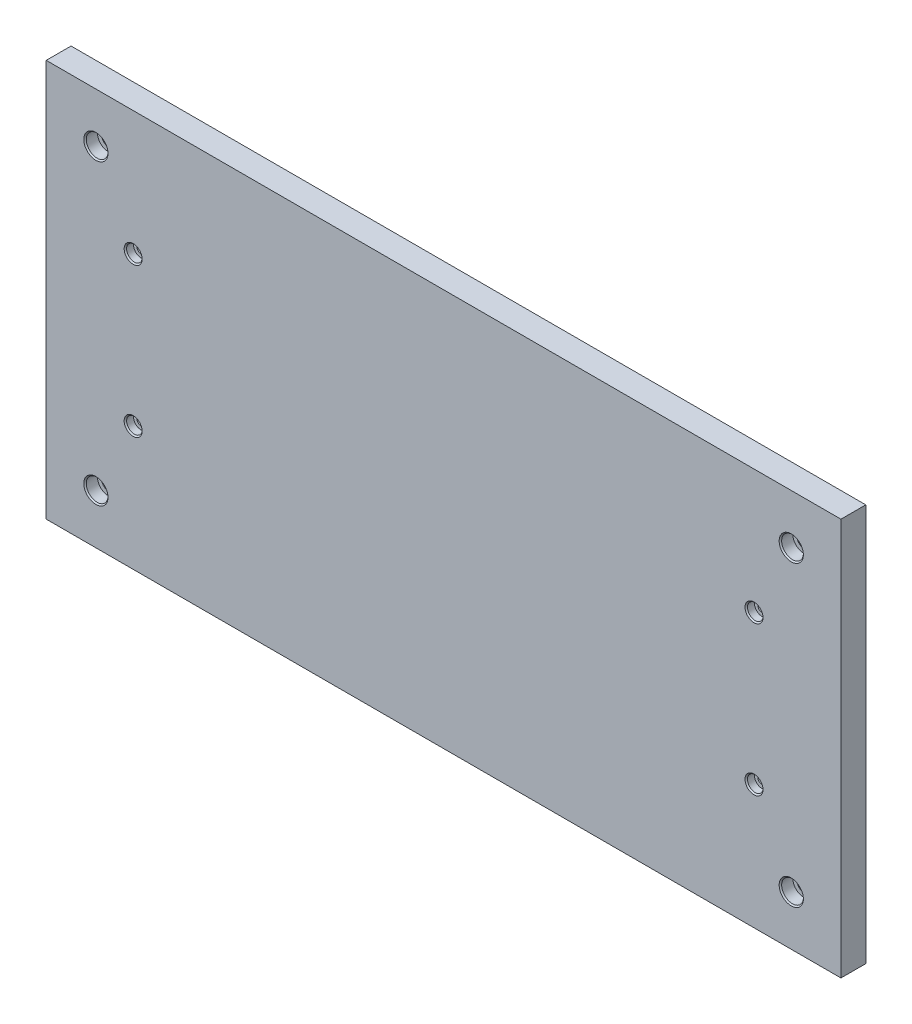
ISO-10303-21;
HEADER;
FILE_DESCRIPTION(('STEP AP214'),'2;1');
FILE_NAME('part.step','',(''),(''),'','','');
FILE_SCHEMA(('AUTOMOTIVE_DESIGN { 1 0 10303 214 1 1 1 1 }'));
ENDSEC;
DATA;
#1=APPLICATION_CONTEXT('core data for automotive mechanical design processes');
#2=APPLICATION_PROTOCOL_DEFINITION('international standard','automotive_design',2000,#1);
#3=PRODUCT_CONTEXT('',#1,'mechanical');
#4=PRODUCT('Part','Part','',(#3));
#5=PRODUCT_RELATED_PRODUCT_CATEGORY('part','',(#4));
#6=PRODUCT_DEFINITION_FORMATION('','',#4);
#7=PRODUCT_DEFINITION_CONTEXT('part definition',#1,'design');
#8=PRODUCT_DEFINITION('design','',#6,#7);
#9=PRODUCT_DEFINITION_SHAPE('','',#8);
#10=(LENGTH_UNIT() NAMED_UNIT(*) SI_UNIT(.MILLI.,.METRE.));
#11=(NAMED_UNIT(*) PLANE_ANGLE_UNIT() SI_UNIT($,.RADIAN.));
#12=(NAMED_UNIT(*) SI_UNIT($,.STERADIAN.) SOLID_ANGLE_UNIT());
#13=UNCERTAINTY_MEASURE_WITH_UNIT(LENGTH_MEASURE(1.E-05),#10,'distance_accuracy_value','');
#14=(GEOMETRIC_REPRESENTATION_CONTEXT(3) GLOBAL_UNCERTAINTY_ASSIGNED_CONTEXT((#13)) GLOBAL_UNIT_ASSIGNED_CONTEXT((#10,
#11,#12)) REPRESENTATION_CONTEXT('',''));
#15=CARTESIAN_POINT('',(0.,0.,0.));
#16=DIRECTION('',(0.,0.,1.));
#17=DIRECTION('',(1.,0.,0.));
#18=AXIS2_PLACEMENT_3D('',#15,#16,#17);
#19=CARTESIAN_POINT('',(-107.332219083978,-40.2352360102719,12.7));
#20=DIRECTION('',(1.,0.,0.));
#21=DIRECTION('',(0.,0.,-1.));
#22=AXIS2_PLACEMENT_3D('',#19,#20,#21);
#23=PLANE('',#22);
#24=DIRECTION('',(0.,-1.,0.));
#25=VECTOR('',#24,1.);
#26=CARTESIAN_POINT('',(-107.332219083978,-40.2352360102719,0.));
#27=LINE('',#26,#25);
#28=CARTESIAN_POINT('',(-107.332219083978,-40.2352360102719,0.));
#29=VERTEX_POINT('',#28);
#30=CARTESIAN_POINT('',(-107.332219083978,-243.435236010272,0.));
#31=VERTEX_POINT('',#30);
#32=EDGE_CURVE('E266',#29,#31,#27,.T.);
#33=ORIENTED_EDGE('',*,*,#32,.T.);
#34=DIRECTION('',(0.,0.,-1.));
#35=VECTOR('',#34,1.);
#36=CARTESIAN_POINT('',(-107.332219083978,-243.435236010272,12.7));
#37=LINE('',#36,#35);
#38=CARTESIAN_POINT('',(-107.332219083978,-243.435236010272,12.7));
#39=VERTEX_POINT('',#38);
#40=EDGE_CURVE('E11',#39,#31,#37,.T.);
#41=ORIENTED_EDGE('',*,*,#40,.F.);
#42=DIRECTION('',(0.,-1.,0.));
#43=VECTOR('',#42,1.);
#44=CARTESIAN_POINT('',(-107.332219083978,-40.2352360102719,12.7));
#45=LINE('',#44,#43);
#46=CARTESIAN_POINT('',(-107.332219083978,-40.2352360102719,12.7));
#47=VERTEX_POINT('',#46);
#48=EDGE_CURVE('E267',#47,#39,#45,.T.);
#49=ORIENTED_EDGE('',*,*,#48,.F.);
#50=DIRECTION('',(0.,0.,-1.));
#51=VECTOR('',#50,1.);
#52=CARTESIAN_POINT('',(-107.332219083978,-40.2352360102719,12.7));
#53=LINE('',#52,#51);
#54=EDGE_CURVE('E277',#47,#29,#53,.T.);
#55=ORIENTED_EDGE('',*,*,#54,.T.);
#56=EDGE_LOOP('',(#33,#41,#49,#55));
#57=FACE_BOUND('',#56,.T.);
#58=ADVANCED_FACE('F45',(#57),#23,.F.);
#59=CARTESIAN_POINT('',(-107.332219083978,-243.435236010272,12.7));
#60=DIRECTION('',(0.,1.,0.));
#61=DIRECTION('',(0.,0.,1.));
#62=AXIS2_PLACEMENT_3D('',#59,#60,#61);
#63=PLANE('',#62);
#64=DIRECTION('',(1.,0.,0.));
#65=VECTOR('',#64,1.);
#66=CARTESIAN_POINT('',(-107.332219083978,-243.435236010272,0.));
#67=LINE('',#66,#65);
#68=CARTESIAN_POINT('',(299.067780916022,-243.435236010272,0.));
#69=VERTEX_POINT('',#68);
#70=EDGE_CURVE('E281',#31,#69,#67,.T.);
#71=ORIENTED_EDGE('',*,*,#70,.T.);
#72=DIRECTION('',(0.,0.,-1.));
#73=VECTOR('',#72,1.);
#74=CARTESIAN_POINT('',(299.067780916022,-243.435236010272,12.7));
#75=LINE('',#74,#73);
#76=CARTESIAN_POINT('',(299.067780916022,-243.435236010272,12.7));
#77=VERTEX_POINT('',#76);
#78=EDGE_CURVE('E54',#77,#69,#75,.T.);
#79=ORIENTED_EDGE('',*,*,#78,.F.);
#80=DIRECTION('',(1.,0.,0.));
#81=VECTOR('',#80,1.);
#82=CARTESIAN_POINT('',(-107.332219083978,-243.435236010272,12.7));
#83=LINE('',#82,#81);
#84=EDGE_CURVE('E93',#39,#77,#83,.T.);
#85=ORIENTED_EDGE('',*,*,#84,.F.);
#86=ORIENTED_EDGE('',*,*,#40,.T.);
#87=EDGE_LOOP('',(#71,#79,#85,#86));
#88=FACE_BOUND('',#87,.T.);
#89=ADVANCED_FACE('F312',(#88),#63,.F.);
#90=CARTESIAN_POINT('',(299.067780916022,-40.2352360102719,12.7));
#91=DIRECTION('',(-1.,0.,0.));
#92=DIRECTION('',(0.,0.,1.));
#93=AXIS2_PLACEMENT_3D('',#90,#91,#92);
#94=PLANE('',#93);
#95=DIRECTION('',(0.,1.,0.));
#96=VECTOR('',#95,1.);
#97=CARTESIAN_POINT('',(299.067780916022,-40.2352360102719,0.));
#98=LINE('',#97,#96);
#99=CARTESIAN_POINT('',(299.067780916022,-40.2352360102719,0.));
#100=VERTEX_POINT('',#99);
#101=EDGE_CURVE('E80',#69,#100,#98,.T.);
#102=ORIENTED_EDGE('',*,*,#101,.T.);
#103=DIRECTION('',(0.,0.,-1.));
#104=VECTOR('',#103,1.);
#105=CARTESIAN_POINT('',(299.067780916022,-40.2352360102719,12.7));
#106=LINE('',#105,#104);
#107=CARTESIAN_POINT('',(299.067780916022,-40.2352360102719,12.7));
#108=VERTEX_POINT('',#107);
#109=EDGE_CURVE('E290',#108,#100,#106,.T.);
#110=ORIENTED_EDGE('',*,*,#109,.F.);
#111=DIRECTION('',(0.,1.,0.));
#112=VECTOR('',#111,1.);
#113=CARTESIAN_POINT('',(299.067780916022,-40.2352360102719,12.7));
#114=LINE('',#113,#112);
#115=EDGE_CURVE('E272',#77,#108,#114,.T.);
#116=ORIENTED_EDGE('',*,*,#115,.F.);
#117=ORIENTED_EDGE('',*,*,#78,.T.);
#118=EDGE_LOOP('',(#102,#110,#116,#117));
#119=FACE_BOUND('',#118,.T.);
#120=ADVANCED_FACE('F295',(#119),#94,.F.);
#121=CARTESIAN_POINT('',(-107.332219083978,-40.2352360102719,12.7));
#122=DIRECTION('',(0.,-1.,0.));
#123=DIRECTION('',(0.,0.,-1.));
#124=AXIS2_PLACEMENT_3D('',#121,#122,#123);
#125=PLANE('',#124);
#126=DIRECTION('',(-1.,0.,0.));
#127=VECTOR('',#126,1.);
#128=CARTESIAN_POINT('',(-107.332219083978,-40.2352360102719,0.));
#129=LINE('',#128,#127);
#130=EDGE_CURVE('E86',#100,#29,#129,.T.);
#131=ORIENTED_EDGE('',*,*,#130,.T.);
#132=ORIENTED_EDGE('',*,*,#54,.F.);
#133=DIRECTION('',(-1.,0.,0.));
#134=VECTOR('',#133,1.);
#135=CARTESIAN_POINT('',(-107.332219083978,-40.2352360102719,12.7));
#136=LINE('',#135,#134);
#137=EDGE_CURVE('E62',#108,#47,#136,.T.);
#138=ORIENTED_EDGE('',*,*,#137,.F.);
#139=ORIENTED_EDGE('',*,*,#109,.T.);
#140=EDGE_LOOP('',(#131,#132,#138,#139));
#141=FACE_BOUND('',#140,.T.);
#142=ADVANCED_FACE('F302',(#141),#125,.F.);
#143=CARTESIAN_POINT('',(0.,0.,12.7));
#144=DIRECTION('',(0.,0.,1.));
#145=DIRECTION('',(1.,0.,0.));
#146=AXIS2_PLACEMENT_3D('',#143,#144,#145);
#147=PLANE('',#146);
#148=CARTESIAN_POINT('',(-62.8822190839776,-179.935236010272,12.7));
#149=DIRECTION('',(0.,0.,1.));
#150=DIRECTION('',(1.,0.,0.));
#151=AXIS2_PLACEMENT_3D('',#148,#149,#150);
#152=CIRCLE('',#151,4.60375);
#153=CARTESIAN_POINT('',(-58.2784690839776,-179.935236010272,12.7));
#154=VERTEX_POINT('',#153);
#155=EDGE_CURVE('E796',#154,#154,#152,.T.);
#156=ORIENTED_EDGE('',*,*,#155,.F.);
#157=EDGE_LOOP('',(#156));
#158=FACE_BOUND('',#157,.T.);
#159=CARTESIAN_POINT('',(254.617780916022,-103.735236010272,12.7));
#160=DIRECTION('',(0.,0.,1.));
#161=DIRECTION('',(1.,0.,0.));
#162=AXIS2_PLACEMENT_3D('',#159,#160,#161);
#163=CIRCLE('',#162,4.60375000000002);
#164=CARTESIAN_POINT('',(259.221530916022,-103.735236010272,12.7));
#165=VERTEX_POINT('',#164);
#166=EDGE_CURVE('E117',#165,#165,#163,.T.);
#167=ORIENTED_EDGE('',*,*,#166,.F.);
#168=EDGE_LOOP('',(#167));
#169=FACE_BOUND('',#168,.T.);
#170=CARTESIAN_POINT('',(254.617780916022,-179.935236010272,12.7));
#171=DIRECTION('',(0.,0.,1.));
#172=DIRECTION('',(1.,0.,0.));
#173=AXIS2_PLACEMENT_3D('',#170,#171,#172);
#174=CIRCLE('',#173,4.60375000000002);
#175=CARTESIAN_POINT('',(259.221530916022,-179.935236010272,12.7));
#176=VERTEX_POINT('',#175);
#177=EDGE_CURVE('E146',#176,#176,#174,.T.);
#178=ORIENTED_EDGE('',*,*,#177,.F.);
#179=EDGE_LOOP('',(#178));
#180=FACE_BOUND('',#179,.T.);
#181=CARTESIAN_POINT('',(-62.8822190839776,-103.735236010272,12.7));
#182=DIRECTION('',(0.,0.,1.));
#183=DIRECTION('',(1.,0.,0.));
#184=AXIS2_PLACEMENT_3D('',#181,#182,#183);
#185=CIRCLE('',#184,4.60375);
#186=CARTESIAN_POINT('',(-58.2784690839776,-103.735236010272,12.7));
#187=VERTEX_POINT('',#186);
#188=EDGE_CURVE('E166',#187,#187,#185,.T.);
#189=ORIENTED_EDGE('',*,*,#188,.F.);
#190=EDGE_LOOP('',(#189));
#191=FACE_BOUND('',#190,.T.);
#192=CARTESIAN_POINT('',(-81.9322190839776,-65.6352360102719,12.7));
#193=DIRECTION('',(0.,0.,1.));
#194=DIRECTION('',(1.,0.,0.));
#195=AXIS2_PLACEMENT_3D('',#192,#193,#194);
#196=CIRCLE('',#195,6.19125);
#197=CARTESIAN_POINT('',(-75.7409690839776,-65.6352360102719,12.7));
#198=VERTEX_POINT('',#197);
#199=EDGE_CURVE('E186',#198,#198,#196,.T.);
#200=ORIENTED_EDGE('',*,*,#199,.F.);
#201=EDGE_LOOP('',(#200));
#202=FACE_BOUND('',#201,.T.);
#203=CARTESIAN_POINT('',(-81.9322190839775,-218.035236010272,12.7));
#204=DIRECTION('',(0.,0.,1.));
#205=DIRECTION('',(1.,0.,0.));
#206=AXIS2_PLACEMENT_3D('',#203,#204,#205);
#207=CIRCLE('',#206,6.19125);
#208=CARTESIAN_POINT('',(-75.7409690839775,-218.035236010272,12.7));
#209=VERTEX_POINT('',#208);
#210=EDGE_CURVE('E206',#209,#209,#207,.T.);
#211=ORIENTED_EDGE('',*,*,#210,.F.);
#212=EDGE_LOOP('',(#211));
#213=FACE_BOUND('',#212,.T.);
#214=CARTESIAN_POINT('',(273.667780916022,-218.035236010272,12.7));
#215=DIRECTION('',(0.,0.,1.));
#216=DIRECTION('',(1.,0.,0.));
#217=AXIS2_PLACEMENT_3D('',#214,#215,#216);
#218=CIRCLE('',#217,6.19124999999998);
#219=CARTESIAN_POINT('',(279.859030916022,-218.035236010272,12.7));
#220=VERTEX_POINT('',#219);
#221=EDGE_CURVE('E226',#220,#220,#218,.T.);
#222=ORIENTED_EDGE('',*,*,#221,.F.);
#223=EDGE_LOOP('',(#222));
#224=FACE_BOUND('',#223,.T.);
#225=CARTESIAN_POINT('',(273.667780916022,-65.6352360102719,12.7));
#226=DIRECTION('',(0.,0.,1.));
#227=DIRECTION('',(1.,0.,0.));
#228=AXIS2_PLACEMENT_3D('',#225,#226,#227);
#229=CIRCLE('',#228,6.19124999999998);
#230=CARTESIAN_POINT('',(279.859030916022,-65.6352360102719,12.7));
#231=VERTEX_POINT('',#230);
#232=EDGE_CURVE('E246',#231,#231,#229,.T.);
#233=ORIENTED_EDGE('',*,*,#232,.F.);
#234=EDGE_LOOP('',(#233));
#235=FACE_BOUND('',#234,.T.);
#236=ORIENTED_EDGE('',*,*,#48,.T.);
#237=ORIENTED_EDGE('',*,*,#84,.T.);
#238=ORIENTED_EDGE('',*,*,#115,.T.);
#239=ORIENTED_EDGE('',*,*,#137,.T.);
#240=EDGE_LOOP('',(#236,#237,#238,#239));
#241=FACE_BOUND('',#240,.T.);
#242=ADVANCED_FACE('F304',(#158,#169,#180,#191,#202,#213,#224,#235,#241),#147,.T.);
#243=CARTESIAN_POINT('',(0.,0.,0.));
#244=DIRECTION('',(0.,0.,1.));
#245=DIRECTION('',(1.,0.,0.));
#246=AXIS2_PLACEMENT_3D('',#243,#244,#245);
#247=PLANE('',#246);
#248=CARTESIAN_POINT('',(-81.9322190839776,-65.6352360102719,0.));
#249=DIRECTION('',(0.,0.,1.));
#250=DIRECTION('',(1.,0.,0.));
#251=AXIS2_PLACEMENT_3D('',#248,#249,#250);
#252=CIRCLE('',#251,3.37820000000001);
#253=CARTESIAN_POINT('',(-78.5540190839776,-65.6352360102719,0.));
#254=VERTEX_POINT('',#253);
#255=EDGE_CURVE('E202',#254,#254,#252,.T.);
#256=ORIENTED_EDGE('',*,*,#255,.T.);
#257=EDGE_LOOP('',(#256));
#258=FACE_BOUND('',#257,.T.);
#259=CARTESIAN_POINT('',(-81.9322190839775,-218.035236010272,0.));
#260=DIRECTION('',(0.,0.,1.));
#261=DIRECTION('',(1.,0.,0.));
#262=AXIS2_PLACEMENT_3D('',#259,#260,#261);
#263=CIRCLE('',#262,3.37820000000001);
#264=CARTESIAN_POINT('',(-78.5540190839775,-218.035236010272,0.));
#265=VERTEX_POINT('',#264);
#266=EDGE_CURVE('E222',#265,#265,#263,.T.);
#267=ORIENTED_EDGE('',*,*,#266,.T.);
#268=EDGE_LOOP('',(#267));
#269=FACE_BOUND('',#268,.T.);
#270=CARTESIAN_POINT('',(273.667780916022,-218.035236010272,0.));
#271=DIRECTION('',(0.,0.,1.));
#272=DIRECTION('',(1.,0.,0.));
#273=AXIS2_PLACEMENT_3D('',#270,#271,#272);
#274=CIRCLE('',#273,3.3782);
#275=CARTESIAN_POINT('',(277.045980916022,-218.035236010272,0.));
#276=VERTEX_POINT('',#275);
#277=EDGE_CURVE('E242',#276,#276,#274,.T.);
#278=ORIENTED_EDGE('',*,*,#277,.T.);
#279=EDGE_LOOP('',(#278));
#280=FACE_BOUND('',#279,.T.);
#281=CARTESIAN_POINT('',(273.667780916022,-65.6352360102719,0.));
#282=DIRECTION('',(0.,0.,1.));
#283=DIRECTION('',(1.,0.,0.));
#284=AXIS2_PLACEMENT_3D('',#281,#282,#283);
#285=CIRCLE('',#284,3.3782);
#286=CARTESIAN_POINT('',(277.045980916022,-65.6352360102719,0.));
#287=VERTEX_POINT('',#286);
#288=EDGE_CURVE('E262',#287,#287,#285,.T.);
#289=ORIENTED_EDGE('',*,*,#288,.T.);
#290=EDGE_LOOP('',(#289));
#291=FACE_BOUND('',#290,.T.);
#292=ORIENTED_EDGE('',*,*,#32,.F.);
#293=ORIENTED_EDGE('',*,*,#130,.F.);
#294=ORIENTED_EDGE('',*,*,#101,.F.);
#295=ORIENTED_EDGE('',*,*,#70,.F.);
#296=EDGE_LOOP('',(#292,#293,#294,#295));
#297=FACE_BOUND('',#296,.T.);
#298=ADVANCED_FACE('F298',(#258,#269,#280,#291,#297),#247,.F.);
#299=CARTESIAN_POINT('',(273.667780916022,-65.6352360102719,12.7));
#300=DIRECTION('',(0.,0.,1.));
#301=DIRECTION('',(1.,0.,0.));
#302=AXIS2_PLACEMENT_3D('',#299,#300,#301);
#303=CYLINDRICAL_SURFACE('',#302,3.3782);
#304=ORIENTED_EDGE('',*,*,#288,.F.);
#305=EDGE_LOOP('',(#304));
#306=FACE_BOUND('',#305,.T.);
#307=CARTESIAN_POINT('',(273.667780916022,-65.6352360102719,6.35));
#308=DIRECTION('',(0.,0.,1.));
#309=DIRECTION('',(1.,0.,0.));
#310=AXIS2_PLACEMENT_3D('',#307,#308,#309);
#311=CIRCLE('',#310,3.3782);
#312=CARTESIAN_POINT('',(277.045980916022,-65.6352360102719,6.35));
#313=VERTEX_POINT('',#312);
#314=EDGE_CURVE('E258',#313,#313,#311,.T.);
#315=ORIENTED_EDGE('',*,*,#314,.T.);
#316=EDGE_LOOP('',(#315));
#317=FACE_BOUND('',#316,.T.);
#318=ADVANCED_FACE('F346',(#306,#317),#303,.F.);
#319=CARTESIAN_POINT('',(279.224030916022,-65.6352360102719,6.35));
#320=DIRECTION('',(0.,0.,-1.));
#321=DIRECTION('',(-1.,0.,0.));
#322=AXIS2_PLACEMENT_3D('',#319,#320,#321);
#323=PLANE('',#322);
#324=ORIENTED_EDGE('',*,*,#314,.F.);
#325=EDGE_LOOP('',(#324));
#326=FACE_BOUND('',#325,.T.);
#327=CARTESIAN_POINT('',(273.667780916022,-65.6352360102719,6.35));
#328=DIRECTION('',(0.,0.,1.));
#329=DIRECTION('',(1.,0.,0.));
#330=AXIS2_PLACEMENT_3D('',#327,#328,#329);
#331=CIRCLE('',#330,5.55624999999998);
#332=CARTESIAN_POINT('',(279.224030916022,-65.6352360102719,6.35));
#333=VERTEX_POINT('',#332);
#334=EDGE_CURVE('E254',#333,#333,#331,.T.);
#335=ORIENTED_EDGE('',*,*,#334,.T.);
#336=EDGE_LOOP('',(#335));
#337=FACE_BOUND('',#336,.T.);
#338=ADVANCED_FACE('F355',(#326,#337),#323,.F.);
#339=CARTESIAN_POINT('',(273.667780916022,-65.6352360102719,12.7));
#340=DIRECTION('',(0.,0.,1.));
#341=DIRECTION('',(1.,0.,0.));
#342=AXIS2_PLACEMENT_3D('',#339,#340,#341);
#343=CYLINDRICAL_SURFACE('',#342,5.55624999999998);
#344=ORIENTED_EDGE('',*,*,#334,.F.);
#345=EDGE_LOOP('',(#344));
#346=FACE_BOUND('',#345,.T.);
#347=CARTESIAN_POINT('',(273.667780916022,-65.6352360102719,12.065));
#348=DIRECTION('',(0.,0.,1.));
#349=DIRECTION('',(1.,0.,0.));
#350=AXIS2_PLACEMENT_3D('',#347,#348,#349);
#351=CIRCLE('',#350,5.55624999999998);
#352=CARTESIAN_POINT('',(279.224030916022,-65.6352360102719,12.065));
#353=VERTEX_POINT('',#352);
#354=EDGE_CURVE('E250',#353,#353,#351,.T.);
#355=ORIENTED_EDGE('',*,*,#354,.T.);
#356=EDGE_LOOP('',(#355));
#357=FACE_BOUND('',#356,.T.);
#358=ADVANCED_FACE('F365',(#346,#357),#343,.F.);
#359=CARTESIAN_POINT('',(273.667780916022,-65.6352360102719,12.7));
#360=DIRECTION('',(0.,0.,1.));
#361=DIRECTION('',(1.,0.,0.));
#362=AXIS2_PLACEMENT_3D('',#359,#360,#361);
#363=CONICAL_SURFACE('',#362,6.19124999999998,0.785398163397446);
#364=ORIENTED_EDGE('',*,*,#354,.F.);
#365=EDGE_LOOP('',(#364));
#366=FACE_BOUND('',#365,.T.);
#367=ORIENTED_EDGE('',*,*,#232,.T.);
#368=EDGE_LOOP('',(#367));
#369=FACE_BOUND('',#368,.T.);
#370=ADVANCED_FACE('F375',(#366,#369),#363,.F.);
#371=CARTESIAN_POINT('',(273.667780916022,-218.035236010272,12.7));
#372=DIRECTION('',(0.,0.,1.));
#373=DIRECTION('',(1.,0.,0.));
#374=AXIS2_PLACEMENT_3D('',#371,#372,#373);
#375=CYLINDRICAL_SURFACE('',#374,3.3782);
#376=ORIENTED_EDGE('',*,*,#277,.F.);
#377=EDGE_LOOP('',(#376));
#378=FACE_BOUND('',#377,.T.);
#379=CARTESIAN_POINT('',(273.667780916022,-218.035236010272,6.35));
#380=DIRECTION('',(0.,0.,1.));
#381=DIRECTION('',(1.,0.,0.));
#382=AXIS2_PLACEMENT_3D('',#379,#380,#381);
#383=CIRCLE('',#382,3.3782);
#384=CARTESIAN_POINT('',(277.045980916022,-218.035236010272,6.35));
#385=VERTEX_POINT('',#384);
#386=EDGE_CURVE('E238',#385,#385,#383,.T.);
#387=ORIENTED_EDGE('',*,*,#386,.T.);
#388=EDGE_LOOP('',(#387));
#389=FACE_BOUND('',#388,.T.);
#390=ADVANCED_FACE('F385',(#378,#389),#375,.F.);
#391=CARTESIAN_POINT('',(279.224030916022,-218.035236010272,6.35));
#392=DIRECTION('',(0.,0.,-1.));
#393=DIRECTION('',(-1.,0.,0.));
#394=AXIS2_PLACEMENT_3D('',#391,#392,#393);
#395=PLANE('',#394);
#396=ORIENTED_EDGE('',*,*,#386,.F.);
#397=EDGE_LOOP('',(#396));
#398=FACE_BOUND('',#397,.T.);
#399=CARTESIAN_POINT('',(273.667780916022,-218.035236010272,6.35));
#400=DIRECTION('',(0.,0.,1.));
#401=DIRECTION('',(1.,0.,0.));
#402=AXIS2_PLACEMENT_3D('',#399,#400,#401);
#403=CIRCLE('',#402,5.55624999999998);
#404=CARTESIAN_POINT('',(279.224030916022,-218.035236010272,6.35));
#405=VERTEX_POINT('',#404);
#406=EDGE_CURVE('E234',#405,#405,#403,.T.);
#407=ORIENTED_EDGE('',*,*,#406,.T.);
#408=EDGE_LOOP('',(#407));
#409=FACE_BOUND('',#408,.T.);
#410=ADVANCED_FACE('F395',(#398,#409),#395,.F.);
#411=CARTESIAN_POINT('',(273.667780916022,-218.035236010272,12.7));
#412=DIRECTION('',(0.,0.,1.));
#413=DIRECTION('',(1.,0.,0.));
#414=AXIS2_PLACEMENT_3D('',#411,#412,#413);
#415=CYLINDRICAL_SURFACE('',#414,5.55624999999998);
#416=ORIENTED_EDGE('',*,*,#406,.F.);
#417=EDGE_LOOP('',(#416));
#418=FACE_BOUND('',#417,.T.);
#419=CARTESIAN_POINT('',(273.667780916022,-218.035236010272,12.065));
#420=DIRECTION('',(0.,0.,1.));
#421=DIRECTION('',(1.,0.,0.));
#422=AXIS2_PLACEMENT_3D('',#419,#420,#421);
#423=CIRCLE('',#422,5.55624999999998);
#424=CARTESIAN_POINT('',(279.224030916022,-218.035236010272,12.065));
#425=VERTEX_POINT('',#424);
#426=EDGE_CURVE('E230',#425,#425,#423,.T.);
#427=ORIENTED_EDGE('',*,*,#426,.T.);
#428=EDGE_LOOP('',(#427));
#429=FACE_BOUND('',#428,.T.);
#430=ADVANCED_FACE('F405',(#418,#429),#415,.F.);
#431=CARTESIAN_POINT('',(273.667780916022,-218.035236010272,12.7));
#432=DIRECTION('',(0.,0.,1.));
#433=DIRECTION('',(1.,0.,0.));
#434=AXIS2_PLACEMENT_3D('',#431,#432,#433);
#435=CONICAL_SURFACE('',#434,6.19124999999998,0.785398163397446);
#436=ORIENTED_EDGE('',*,*,#426,.F.);
#437=EDGE_LOOP('',(#436));
#438=FACE_BOUND('',#437,.T.);
#439=ORIENTED_EDGE('',*,*,#221,.T.);
#440=EDGE_LOOP('',(#439));
#441=FACE_BOUND('',#440,.T.);
#442=ADVANCED_FACE('F415',(#438,#441),#435,.F.);
#443=CARTESIAN_POINT('',(-81.9322190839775,-218.035236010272,12.7));
#444=DIRECTION('',(0.,0.,1.));
#445=DIRECTION('',(1.,0.,0.));
#446=AXIS2_PLACEMENT_3D('',#443,#444,#445);
#447=CYLINDRICAL_SURFACE('',#446,3.3782);
#448=ORIENTED_EDGE('',*,*,#266,.F.);
#449=EDGE_LOOP('',(#448));
#450=FACE_BOUND('',#449,.T.);
#451=CARTESIAN_POINT('',(-81.9322190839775,-218.035236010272,6.35));
#452=DIRECTION('',(0.,0.,1.));
#453=DIRECTION('',(1.,0.,0.));
#454=AXIS2_PLACEMENT_3D('',#451,#452,#453);
#455=CIRCLE('',#454,3.3782);
#456=CARTESIAN_POINT('',(-78.5540190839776,-218.035236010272,6.35));
#457=VERTEX_POINT('',#456);
#458=EDGE_CURVE('E218',#457,#457,#455,.T.);
#459=ORIENTED_EDGE('',*,*,#458,.T.);
#460=EDGE_LOOP('',(#459));
#461=FACE_BOUND('',#460,.T.);
#462=ADVANCED_FACE('F425',(#450,#461),#447,.F.);
#463=CARTESIAN_POINT('',(-76.3759690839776,-218.035236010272,6.35));
#464=DIRECTION('',(0.,0.,-1.));
#465=DIRECTION('',(-1.,0.,0.));
#466=AXIS2_PLACEMENT_3D('',#463,#464,#465);
#467=PLANE('',#466);
#468=ORIENTED_EDGE('',*,*,#458,.F.);
#469=EDGE_LOOP('',(#468));
#470=FACE_BOUND('',#469,.T.);
#471=CARTESIAN_POINT('',(-81.9322190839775,-218.035236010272,6.35));
#472=DIRECTION('',(0.,0.,1.));
#473=DIRECTION('',(1.,0.,0.));
#474=AXIS2_PLACEMENT_3D('',#471,#472,#473);
#475=CIRCLE('',#474,5.55625);
#476=CARTESIAN_POINT('',(-76.3759690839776,-218.035236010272,6.35));
#477=VERTEX_POINT('',#476);
#478=EDGE_CURVE('E214',#477,#477,#475,.T.);
#479=ORIENTED_EDGE('',*,*,#478,.T.);
#480=EDGE_LOOP('',(#479));
#481=FACE_BOUND('',#480,.T.);
#482=ADVANCED_FACE('F435',(#470,#481),#467,.F.);
#483=CARTESIAN_POINT('',(-81.9322190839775,-218.035236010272,12.7));
#484=DIRECTION('',(0.,0.,1.));
#485=DIRECTION('',(1.,0.,0.));
#486=AXIS2_PLACEMENT_3D('',#483,#484,#485);
#487=CYLINDRICAL_SURFACE('',#486,5.55625);
#488=ORIENTED_EDGE('',*,*,#478,.F.);
#489=EDGE_LOOP('',(#488));
#490=FACE_BOUND('',#489,.T.);
#491=CARTESIAN_POINT('',(-81.9322190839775,-218.035236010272,12.065));
#492=DIRECTION('',(0.,0.,1.));
#493=DIRECTION('',(1.,0.,0.));
#494=AXIS2_PLACEMENT_3D('',#491,#492,#493);
#495=CIRCLE('',#494,5.55625);
#496=CARTESIAN_POINT('',(-76.3759690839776,-218.035236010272,12.065));
#497=VERTEX_POINT('',#496);
#498=EDGE_CURVE('E210',#497,#497,#495,.T.);
#499=ORIENTED_EDGE('',*,*,#498,.T.);
#500=EDGE_LOOP('',(#499));
#501=FACE_BOUND('',#500,.T.);
#502=ADVANCED_FACE('F445',(#490,#501),#487,.F.);
#503=CARTESIAN_POINT('',(-81.9322190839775,-218.035236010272,12.7));
#504=DIRECTION('',(0.,0.,1.));
#505=DIRECTION('',(1.,0.,0.));
#506=AXIS2_PLACEMENT_3D('',#503,#504,#505);
#507=CONICAL_SURFACE('',#506,6.19125,0.785398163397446);
#508=ORIENTED_EDGE('',*,*,#498,.F.);
#509=EDGE_LOOP('',(#508));
#510=FACE_BOUND('',#509,.T.);
#511=ORIENTED_EDGE('',*,*,#210,.T.);
#512=EDGE_LOOP('',(#511));
#513=FACE_BOUND('',#512,.T.);
#514=ADVANCED_FACE('F455',(#510,#513),#507,.F.);
#515=CARTESIAN_POINT('',(-81.9322190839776,-65.6352360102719,12.7));
#516=DIRECTION('',(0.,0.,1.));
#517=DIRECTION('',(1.,0.,0.));
#518=AXIS2_PLACEMENT_3D('',#515,#516,#517);
#519=CYLINDRICAL_SURFACE('',#518,3.3782);
#520=ORIENTED_EDGE('',*,*,#255,.F.);
#521=EDGE_LOOP('',(#520));
#522=FACE_BOUND('',#521,.T.);
#523=CARTESIAN_POINT('',(-81.9322190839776,-65.6352360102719,6.35));
#524=DIRECTION('',(0.,0.,1.));
#525=DIRECTION('',(1.,0.,0.));
#526=AXIS2_PLACEMENT_3D('',#523,#524,#525);
#527=CIRCLE('',#526,3.3782);
#528=CARTESIAN_POINT('',(-78.5540190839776,-65.6352360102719,6.35));
#529=VERTEX_POINT('',#528);
#530=EDGE_CURVE('E198',#529,#529,#527,.T.);
#531=ORIENTED_EDGE('',*,*,#530,.T.);
#532=EDGE_LOOP('',(#531));
#533=FACE_BOUND('',#532,.T.);
#534=ADVANCED_FACE('F465',(#522,#533),#519,.F.);
#535=CARTESIAN_POINT('',(-76.3759690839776,-65.6352360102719,6.35));
#536=DIRECTION('',(0.,0.,-1.));
#537=DIRECTION('',(-1.,0.,0.));
#538=AXIS2_PLACEMENT_3D('',#535,#536,#537);
#539=PLANE('',#538);
#540=ORIENTED_EDGE('',*,*,#530,.F.);
#541=EDGE_LOOP('',(#540));
#542=FACE_BOUND('',#541,.T.);
#543=CARTESIAN_POINT('',(-81.9322190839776,-65.6352360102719,6.35));
#544=DIRECTION('',(0.,0.,1.));
#545=DIRECTION('',(1.,0.,0.));
#546=AXIS2_PLACEMENT_3D('',#543,#544,#545);
#547=CIRCLE('',#546,5.55625);
#548=CARTESIAN_POINT('',(-76.3759690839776,-65.6352360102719,6.35));
#549=VERTEX_POINT('',#548);
#550=EDGE_CURVE('E194',#549,#549,#547,.T.);
#551=ORIENTED_EDGE('',*,*,#550,.T.);
#552=EDGE_LOOP('',(#551));
#553=FACE_BOUND('',#552,.T.);
#554=ADVANCED_FACE('F475',(#542,#553),#539,.F.);
#555=CARTESIAN_POINT('',(-81.9322190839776,-65.6352360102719,12.7));
#556=DIRECTION('',(0.,0.,1.));
#557=DIRECTION('',(1.,0.,0.));
#558=AXIS2_PLACEMENT_3D('',#555,#556,#557);
#559=CYLINDRICAL_SURFACE('',#558,5.55625);
#560=ORIENTED_EDGE('',*,*,#550,.F.);
#561=EDGE_LOOP('',(#560));
#562=FACE_BOUND('',#561,.T.);
#563=CARTESIAN_POINT('',(-81.9322190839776,-65.6352360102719,12.065));
#564=DIRECTION('',(0.,0.,1.));
#565=DIRECTION('',(1.,0.,0.));
#566=AXIS2_PLACEMENT_3D('',#563,#564,#565);
#567=CIRCLE('',#566,5.55625);
#568=CARTESIAN_POINT('',(-76.3759690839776,-65.6352360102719,12.065));
#569=VERTEX_POINT('',#568);
#570=EDGE_CURVE('E190',#569,#569,#567,.T.);
#571=ORIENTED_EDGE('',*,*,#570,.T.);
#572=EDGE_LOOP('',(#571));
#573=FACE_BOUND('',#572,.T.);
#574=ADVANCED_FACE('F485',(#562,#573),#559,.F.);
#575=CARTESIAN_POINT('',(-81.9322190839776,-65.6352360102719,12.7));
#576=DIRECTION('',(0.,0.,1.));
#577=DIRECTION('',(1.,0.,0.));
#578=AXIS2_PLACEMENT_3D('',#575,#576,#577);
#579=CONICAL_SURFACE('',#578,6.19125,0.785398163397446);
#580=ORIENTED_EDGE('',*,*,#570,.F.);
#581=EDGE_LOOP('',(#580));
#582=FACE_BOUND('',#581,.T.);
#583=ORIENTED_EDGE('',*,*,#199,.T.);
#584=EDGE_LOOP('',(#583));
#585=FACE_BOUND('',#584,.T.);
#586=ADVANCED_FACE('F495',(#582,#585),#579,.F.);
#587=CARTESIAN_POINT('',(-62.8822190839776,-103.735236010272,2.54));
#588=DIRECTION('',(0.,0.,1.));
#589=DIRECTION('',(1.,0.,0.));
#590=AXIS2_PLACEMENT_3D('',#587,#588,#589);
#591=CONICAL_SURFACE('',#590,2.2479,1.02974425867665);
#592=CARTESIAN_POINT('',(-62.8822190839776,-103.735236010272,1.18932541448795));
#593=VERTEX_POINT('',#592);
#594=VERTEX_LOOP('',#593);
#595=FACE_BOUND('',#594,.T.);
#596=CARTESIAN_POINT('',(-62.8822190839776,-103.735236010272,2.54));
#597=DIRECTION('',(0.,0.,1.));
#598=DIRECTION('',(1.,0.,0.));
#599=AXIS2_PLACEMENT_3D('',#596,#597,#598);
#600=CIRCLE('',#599,2.2479);
#601=CARTESIAN_POINT('',(-60.6343190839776,-103.735236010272,2.54));
#602=VERTEX_POINT('',#601);
#603=EDGE_CURVE('E182',#602,#602,#600,.T.);
#604=ORIENTED_EDGE('',*,*,#603,.T.);
#605=EDGE_LOOP('',(#604));
#606=FACE_BOUND('',#605,.T.);
#607=ADVANCED_FACE('F505',(#595,#606),#591,.F.);
#608=CARTESIAN_POINT('',(-62.8822190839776,-103.735236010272,12.7));
#609=DIRECTION('',(0.,0.,1.));
#610=DIRECTION('',(1.,0.,0.));
#611=AXIS2_PLACEMENT_3D('',#608,#609,#610);
#612=CYLINDRICAL_SURFACE('',#611,2.2479);
#613=ORIENTED_EDGE('',*,*,#603,.F.);
#614=EDGE_LOOP('',(#613));
#615=FACE_BOUND('',#614,.T.);
#616=CARTESIAN_POINT('',(-62.8822190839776,-103.735236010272,8.53440000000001));
#617=DIRECTION('',(0.,0.,1.));
#618=DIRECTION('',(1.,0.,0.));
#619=AXIS2_PLACEMENT_3D('',#616,#617,#618);
#620=CIRCLE('',#619,2.2479);
#621=CARTESIAN_POINT('',(-60.6343190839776,-103.735236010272,8.53440000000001));
#622=VERTEX_POINT('',#621);
#623=EDGE_CURVE('E178',#622,#622,#620,.T.);
#624=ORIENTED_EDGE('',*,*,#623,.T.);
#625=EDGE_LOOP('',(#624));
#626=FACE_BOUND('',#625,.T.);
#627=ADVANCED_FACE('F515',(#615,#626),#612,.F.);
#628=CARTESIAN_POINT('',(-60.6343190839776,-103.735236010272,8.53440000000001));
#629=DIRECTION('',(0.,0.,-1.));
#630=DIRECTION('',(-1.,0.,0.));
#631=AXIS2_PLACEMENT_3D('',#628,#629,#630);
#632=PLANE('',#631);
#633=ORIENTED_EDGE('',*,*,#623,.F.);
#634=EDGE_LOOP('',(#633));
#635=FACE_BOUND('',#634,.T.);
#636=CARTESIAN_POINT('',(-62.8822190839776,-103.735236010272,8.53440000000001));
#637=DIRECTION('',(0.,0.,1.));
#638=DIRECTION('',(1.,0.,0.));
#639=AXIS2_PLACEMENT_3D('',#636,#637,#638);
#640=CIRCLE('',#639,3.96874999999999);
#641=CARTESIAN_POINT('',(-58.9134690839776,-103.735236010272,8.53440000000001));
#642=VERTEX_POINT('',#641);
#643=EDGE_CURVE('E174',#642,#642,#640,.T.);
#644=ORIENTED_EDGE('',*,*,#643,.T.);
#645=EDGE_LOOP('',(#644));
#646=FACE_BOUND('',#645,.T.);
#647=ADVANCED_FACE('F525',(#635,#646),#632,.F.);
#648=CARTESIAN_POINT('',(-62.8822190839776,-103.735236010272,12.7));
#649=DIRECTION('',(0.,0.,1.));
#650=DIRECTION('',(1.,0.,0.));
#651=AXIS2_PLACEMENT_3D('',#648,#649,#650);
#652=CYLINDRICAL_SURFACE('',#651,3.96875);
#653=ORIENTED_EDGE('',*,*,#643,.F.);
#654=EDGE_LOOP('',(#653));
#655=FACE_BOUND('',#654,.T.);
#656=CARTESIAN_POINT('',(-62.8822190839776,-103.735236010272,12.065));
#657=DIRECTION('',(0.,0.,1.));
#658=DIRECTION('',(1.,0.,0.));
#659=AXIS2_PLACEMENT_3D('',#656,#657,#658);
#660=CIRCLE('',#659,3.96875);
#661=CARTESIAN_POINT('',(-58.9134690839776,-103.735236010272,12.065));
#662=VERTEX_POINT('',#661);
#663=EDGE_CURVE('E170',#662,#662,#660,.T.);
#664=ORIENTED_EDGE('',*,*,#663,.T.);
#665=EDGE_LOOP('',(#664));
#666=FACE_BOUND('',#665,.T.);
#667=ADVANCED_FACE('F535',(#655,#666),#652,.F.);
#668=CARTESIAN_POINT('',(-62.8822190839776,-103.735236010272,12.7));
#669=DIRECTION('',(0.,0.,1.));
#670=DIRECTION('',(1.,0.,0.));
#671=AXIS2_PLACEMENT_3D('',#668,#669,#670);
#672=CONICAL_SURFACE('',#671,4.60375,0.785398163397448);
#673=ORIENTED_EDGE('',*,*,#663,.F.);
#674=EDGE_LOOP('',(#673));
#675=FACE_BOUND('',#674,.T.);
#676=ORIENTED_EDGE('',*,*,#188,.T.);
#677=EDGE_LOOP('',(#676));
#678=FACE_BOUND('',#677,.T.);
#679=ADVANCED_FACE('F545',(#675,#678),#672,.F.);
#680=CARTESIAN_POINT('',(254.617780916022,-179.935236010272,2.54));
#681=DIRECTION('',(0.,0.,1.));
#682=DIRECTION('',(1.,0.,0.));
#683=AXIS2_PLACEMENT_3D('',#680,#681,#682);
#684=CONICAL_SURFACE('',#683,2.24790000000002,1.02974425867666);
#685=CARTESIAN_POINT('',(254.617780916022,-179.935236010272,1.18932541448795));
#686=VERTEX_POINT('',#685);
#687=VERTEX_LOOP('',#686);
#688=FACE_BOUND('',#687,.T.);
#689=CARTESIAN_POINT('',(254.617780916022,-179.935236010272,2.54));
#690=DIRECTION('',(0.,0.,1.));
#691=DIRECTION('',(1.,0.,0.));
#692=AXIS2_PLACEMENT_3D('',#689,#690,#691);
#693=CIRCLE('',#692,2.24790000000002);
#694=CARTESIAN_POINT('',(256.865680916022,-179.935236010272,2.54));
#695=VERTEX_POINT('',#694);
#696=EDGE_CURVE('E162',#695,#695,#693,.T.);
#697=ORIENTED_EDGE('',*,*,#696,.T.);
#698=EDGE_LOOP('',(#697));
#699=FACE_BOUND('',#698,.T.);
#700=ADVANCED_FACE('F554',(#688,#699),#684,.F.);
#701=CARTESIAN_POINT('',(254.617780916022,-179.935236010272,12.7));
#702=DIRECTION('',(0.,0.,1.));
#703=DIRECTION('',(1.,0.,0.));
#704=AXIS2_PLACEMENT_3D('',#701,#702,#703);
#705=CYLINDRICAL_SURFACE('',#704,2.24790000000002);
#706=ORIENTED_EDGE('',*,*,#696,.F.);
#707=EDGE_LOOP('',(#706));
#708=FACE_BOUND('',#707,.T.);
#709=CARTESIAN_POINT('',(254.617780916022,-179.935236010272,8.53440000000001));
#710=DIRECTION('',(0.,0.,1.));
#711=DIRECTION('',(1.,0.,0.));
#712=AXIS2_PLACEMENT_3D('',#709,#710,#711);
#713=CIRCLE('',#712,2.24790000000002);
#714=CARTESIAN_POINT('',(256.865680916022,-179.935236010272,8.53440000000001));
#715=VERTEX_POINT('',#714);
#716=EDGE_CURVE('E158',#715,#715,#713,.T.);
#717=ORIENTED_EDGE('',*,*,#716,.T.);
#718=EDGE_LOOP('',(#717));
#719=FACE_BOUND('',#718,.T.);
#720=ADVANCED_FACE('F563',(#708,#719),#705,.F.);
#721=CARTESIAN_POINT('',(256.865680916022,-179.935236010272,8.53440000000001));
#722=DIRECTION('',(0.,0.,-1.));
#723=DIRECTION('',(-1.,0.,0.));
#724=AXIS2_PLACEMENT_3D('',#721,#722,#723);
#725=PLANE('',#724);
#726=ORIENTED_EDGE('',*,*,#716,.F.);
#727=EDGE_LOOP('',(#726));
#728=FACE_BOUND('',#727,.T.);
#729=CARTESIAN_POINT('',(254.617780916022,-179.935236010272,8.53440000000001));
#730=DIRECTION('',(0.,0.,1.));
#731=DIRECTION('',(1.,0.,0.));
#732=AXIS2_PLACEMENT_3D('',#729,#730,#731);
#733=CIRCLE('',#732,3.96875000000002);
#734=CARTESIAN_POINT('',(258.586530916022,-179.935236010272,8.53440000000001));
#735=VERTEX_POINT('',#734);
#736=EDGE_CURVE('E154',#735,#735,#733,.T.);
#737=ORIENTED_EDGE('',*,*,#736,.T.);
#738=EDGE_LOOP('',(#737));
#739=FACE_BOUND('',#738,.T.);
#740=ADVANCED_FACE('F573',(#728,#739),#725,.F.);
#741=CARTESIAN_POINT('',(254.617780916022,-179.935236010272,12.7));
#742=DIRECTION('',(0.,0.,1.));
#743=DIRECTION('',(1.,0.,0.));
#744=AXIS2_PLACEMENT_3D('',#741,#742,#743);
#745=CYLINDRICAL_SURFACE('',#744,3.96875000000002);
#746=ORIENTED_EDGE('',*,*,#736,.F.);
#747=EDGE_LOOP('',(#746));
#748=FACE_BOUND('',#747,.T.);
#749=CARTESIAN_POINT('',(254.617780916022,-179.935236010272,12.065));
#750=DIRECTION('',(0.,0.,1.));
#751=DIRECTION('',(1.,0.,0.));
#752=AXIS2_PLACEMENT_3D('',#749,#750,#751);
#753=CIRCLE('',#752,3.96875000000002);
#754=CARTESIAN_POINT('',(258.586530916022,-179.935236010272,12.065));
#755=VERTEX_POINT('',#754);
#756=EDGE_CURVE('E150',#755,#755,#753,.T.);
#757=ORIENTED_EDGE('',*,*,#756,.T.);
#758=EDGE_LOOP('',(#757));
#759=FACE_BOUND('',#758,.T.);
#760=ADVANCED_FACE('F583',(#748,#759),#745,.F.);
#761=CARTESIAN_POINT('',(254.617780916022,-179.935236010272,12.7));
#762=DIRECTION('',(0.,0.,1.));
#763=DIRECTION('',(1.,0.,0.));
#764=AXIS2_PLACEMENT_3D('',#761,#762,#763);
#765=CONICAL_SURFACE('',#764,4.60375000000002,0.785398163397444);
#766=ORIENTED_EDGE('',*,*,#756,.F.);
#767=EDGE_LOOP('',(#766));
#768=FACE_BOUND('',#767,.T.);
#769=ORIENTED_EDGE('',*,*,#177,.T.);
#770=EDGE_LOOP('',(#769));
#771=FACE_BOUND('',#770,.T.);
#772=ADVANCED_FACE('F593',(#768,#771),#765,.F.);
#773=CARTESIAN_POINT('',(254.617780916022,-103.735236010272,2.54));
#774=DIRECTION('',(0.,0.,1.));
#775=DIRECTION('',(1.,0.,0.));
#776=AXIS2_PLACEMENT_3D('',#773,#774,#775);
#777=CONICAL_SURFACE('',#776,2.24790000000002,1.02974425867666);
#778=CARTESIAN_POINT('',(254.617780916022,-103.735236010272,1.18932541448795));
#779=VERTEX_POINT('',#778);
#780=VERTEX_LOOP('',#779);
#781=FACE_BOUND('',#780,.T.);
#782=CARTESIAN_POINT('',(254.617780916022,-103.735236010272,2.54));
#783=DIRECTION('',(0.,0.,1.));
#784=DIRECTION('',(1.,0.,0.));
#785=AXIS2_PLACEMENT_3D('',#782,#783,#784);
#786=CIRCLE('',#785,2.24790000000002);
#787=CARTESIAN_POINT('',(256.865680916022,-103.735236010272,2.54));
#788=VERTEX_POINT('',#787);
#789=EDGE_CURVE('E142',#788,#788,#786,.T.);
#790=ORIENTED_EDGE('',*,*,#789,.T.);
#791=EDGE_LOOP('',(#790));
#792=FACE_BOUND('',#791,.T.);
#793=ADVANCED_FACE('F603',(#781,#792),#777,.F.);
#794=CARTESIAN_POINT('',(254.617780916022,-103.735236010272,12.7));
#795=DIRECTION('',(0.,0.,1.));
#796=DIRECTION('',(1.,0.,0.));
#797=AXIS2_PLACEMENT_3D('',#794,#795,#796);
#798=CYLINDRICAL_SURFACE('',#797,2.24790000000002);
#799=ORIENTED_EDGE('',*,*,#789,.F.);
#800=EDGE_LOOP('',(#799));
#801=FACE_BOUND('',#800,.T.);
#802=CARTESIAN_POINT('',(254.617780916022,-103.735236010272,8.53440000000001));
#803=DIRECTION('',(0.,0.,1.));
#804=DIRECTION('',(1.,0.,0.));
#805=AXIS2_PLACEMENT_3D('',#802,#803,#804);
#806=CIRCLE('',#805,2.24790000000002);
#807=CARTESIAN_POINT('',(256.865680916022,-103.735236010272,8.53440000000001));
#808=VERTEX_POINT('',#807);
#809=EDGE_CURVE('E138',#808,#808,#806,.T.);
#810=ORIENTED_EDGE('',*,*,#809,.T.);
#811=EDGE_LOOP('',(#810));
#812=FACE_BOUND('',#811,.T.);
#813=ADVANCED_FACE('F613',(#801,#812),#798,.F.);
#814=CARTESIAN_POINT('',(256.865680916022,-103.735236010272,8.53440000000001));
#815=DIRECTION('',(0.,0.,-1.));
#816=DIRECTION('',(-1.,0.,0.));
#817=AXIS2_PLACEMENT_3D('',#814,#815,#816);
#818=PLANE('',#817);
#819=ORIENTED_EDGE('',*,*,#809,.F.);
#820=EDGE_LOOP('',(#819));
#821=FACE_BOUND('',#820,.T.);
#822=CARTESIAN_POINT('',(254.617780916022,-103.735236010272,8.53440000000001));
#823=DIRECTION('',(0.,0.,1.));
#824=DIRECTION('',(1.,0.,0.));
#825=AXIS2_PLACEMENT_3D('',#822,#823,#824);
#826=CIRCLE('',#825,3.96875000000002);
#827=CARTESIAN_POINT('',(258.586530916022,-103.735236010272,8.53440000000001));
#828=VERTEX_POINT('',#827);
#829=EDGE_CURVE('E134',#828,#828,#826,.T.);
#830=ORIENTED_EDGE('',*,*,#829,.T.);
#831=EDGE_LOOP('',(#830));
#832=FACE_BOUND('',#831,.T.);
#833=ADVANCED_FACE('F623',(#821,#832),#818,.F.);
#834=CARTESIAN_POINT('',(254.617780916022,-103.735236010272,12.7));
#835=DIRECTION('',(0.,0.,1.));
#836=DIRECTION('',(1.,0.,0.));
#837=AXIS2_PLACEMENT_3D('',#834,#835,#836);
#838=CYLINDRICAL_SURFACE('',#837,3.96875000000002);
#839=ORIENTED_EDGE('',*,*,#829,.F.);
#840=EDGE_LOOP('',(#839));
#841=FACE_BOUND('',#840,.T.);
#842=CARTESIAN_POINT('',(254.617780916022,-103.735236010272,12.065));
#843=DIRECTION('',(0.,0.,1.));
#844=DIRECTION('',(1.,0.,0.));
#845=AXIS2_PLACEMENT_3D('',#842,#843,#844);
#846=CIRCLE('',#845,3.96875000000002);
#847=CARTESIAN_POINT('',(258.586530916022,-103.735236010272,12.065));
#848=VERTEX_POINT('',#847);
#849=EDGE_CURVE('E124',#848,#848,#846,.T.);
#850=ORIENTED_EDGE('',*,*,#849,.T.);
#851=EDGE_LOOP('',(#850));
#852=FACE_BOUND('',#851,.T.);
#853=ADVANCED_FACE('F633',(#841,#852),#838,.F.);
#854=CARTESIAN_POINT('',(254.617780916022,-103.735236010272,12.7));
#855=DIRECTION('',(0.,0.,1.));
#856=DIRECTION('',(1.,0.,0.));
#857=AXIS2_PLACEMENT_3D('',#854,#855,#856);
#858=CONICAL_SURFACE('',#857,4.60375000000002,0.785398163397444);
#859=ORIENTED_EDGE('',*,*,#849,.F.);
#860=EDGE_LOOP('',(#859));
#861=FACE_BOUND('',#860,.T.);
#862=ORIENTED_EDGE('',*,*,#166,.T.);
#863=EDGE_LOOP('',(#862));
#864=FACE_BOUND('',#863,.T.);
#865=ADVANCED_FACE('F110',(#861,#864),#858,.F.);
#866=CARTESIAN_POINT('',(-62.8822190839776,-179.935236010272,2.54));
#867=DIRECTION('',(0.,0.,1.));
#868=DIRECTION('',(1.,0.,0.));
#869=AXIS2_PLACEMENT_3D('',#866,#867,#868);
#870=CONICAL_SURFACE('',#869,2.2479,1.02974425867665);
#871=CARTESIAN_POINT('',(-62.8822190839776,-179.935236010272,1.18932541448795));
#872=VERTEX_POINT('',#871);
#873=VERTEX_LOOP('',#872);
#874=FACE_BOUND('',#873,.T.);
#875=CARTESIAN_POINT('',(-62.8822190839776,-179.935236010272,2.54));
#876=DIRECTION('',(0.,0.,1.));
#877=DIRECTION('',(1.,0.,0.));
#878=AXIS2_PLACEMENT_3D('',#875,#876,#877);
#879=CIRCLE('',#878,2.2479);
#880=CARTESIAN_POINT('',(-60.6343190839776,-179.935236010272,2.54));
#881=VERTEX_POINT('',#880);
#882=EDGE_CURVE('E114',#881,#881,#879,.T.);
#883=ORIENTED_EDGE('',*,*,#882,.T.);
#884=EDGE_LOOP('',(#883));
#885=FACE_BOUND('',#884,.T.);
#886=ADVANCED_FACE('F106',(#874,#885),#870,.F.);
#887=CARTESIAN_POINT('',(-62.8822190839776,-179.935236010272,12.7));
#888=DIRECTION('',(0.,0.,1.));
#889=DIRECTION('',(1.,0.,0.));
#890=AXIS2_PLACEMENT_3D('',#887,#888,#889);
#891=CYLINDRICAL_SURFACE('',#890,2.2479);
#892=ORIENTED_EDGE('',*,*,#882,.F.);
#893=EDGE_LOOP('',(#892));
#894=FACE_BOUND('',#893,.T.);
#895=CARTESIAN_POINT('',(-62.8822190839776,-179.935236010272,8.53440000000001));
#896=DIRECTION('',(0.,0.,1.));
#897=DIRECTION('',(1.,0.,0.));
#898=AXIS2_PLACEMENT_3D('',#895,#896,#897);
#899=CIRCLE('',#898,2.2479);
#900=CARTESIAN_POINT('',(-60.6343190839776,-179.935236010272,8.53440000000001));
#901=VERTEX_POINT('',#900);
#902=EDGE_CURVE('E118',#901,#901,#899,.T.);
#903=ORIENTED_EDGE('',*,*,#902,.T.);
#904=EDGE_LOOP('',(#903));
#905=FACE_BOUND('',#904,.T.);
#906=ADVANCED_FACE('F109',(#894,#905),#891,.F.);
#907=CARTESIAN_POINT('',(-60.6343190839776,-179.935236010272,8.53440000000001));
#908=DIRECTION('',(0.,0.,-1.));
#909=DIRECTION('',(-1.,0.,0.));
#910=AXIS2_PLACEMENT_3D('',#907,#908,#909);
#911=PLANE('',#910);
#912=ORIENTED_EDGE('',*,*,#902,.F.);
#913=EDGE_LOOP('',(#912));
#914=FACE_BOUND('',#913,.T.);
#915=CARTESIAN_POINT('',(-62.8822190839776,-179.935236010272,8.53440000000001));
#916=DIRECTION('',(0.,0.,1.));
#917=DIRECTION('',(1.,0.,0.));
#918=AXIS2_PLACEMENT_3D('',#915,#916,#917);
#919=CIRCLE('',#918,3.96874999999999);
#920=CARTESIAN_POINT('',(-58.9134690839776,-179.935236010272,8.53440000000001));
#921=VERTEX_POINT('',#920);
#922=EDGE_CURVE('E127',#921,#921,#919,.T.);
#923=ORIENTED_EDGE('',*,*,#922,.T.);
#924=EDGE_LOOP('',(#923));
#925=FACE_BOUND('',#924,.T.);
#926=ADVANCED_FACE('F667',(#914,#925),#911,.F.);
#927=CARTESIAN_POINT('',(-62.8822190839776,-179.935236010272,12.7));
#928=DIRECTION('',(0.,0.,1.));
#929=DIRECTION('',(1.,0.,0.));
#930=AXIS2_PLACEMENT_3D('',#927,#928,#929);
#931=CYLINDRICAL_SURFACE('',#930,3.96874999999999);
#932=ORIENTED_EDGE('',*,*,#922,.F.);
#933=EDGE_LOOP('',(#932));
#934=FACE_BOUND('',#933,.T.);
#935=CARTESIAN_POINT('',(-62.8822190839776,-179.935236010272,12.065));
#936=DIRECTION('',(0.,0.,1.));
#937=DIRECTION('',(1.,0.,0.));
#938=AXIS2_PLACEMENT_3D('',#935,#936,#937);
#939=CIRCLE('',#938,3.96874999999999);
#940=CARTESIAN_POINT('',(-58.9134690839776,-179.935236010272,12.065));
#941=VERTEX_POINT('',#940);
#942=EDGE_CURVE('E793',#941,#941,#939,.T.);
#943=ORIENTED_EDGE('',*,*,#942,.T.);
#944=EDGE_LOOP('',(#943));
#945=FACE_BOUND('',#944,.T.);
#946=ADVANCED_FACE('F676',(#934,#945),#931,.F.);
#947=CARTESIAN_POINT('',(-62.8822190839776,-179.935236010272,12.7));
#948=DIRECTION('',(0.,0.,1.));
#949=DIRECTION('',(1.,0.,0.));
#950=AXIS2_PLACEMENT_3D('',#947,#948,#949);
#951=CONICAL_SURFACE('',#950,4.60375,0.785398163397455);
#952=ORIENTED_EDGE('',*,*,#942,.F.);
#953=EDGE_LOOP('',(#952));
#954=FACE_BOUND('',#953,.T.);
#955=ORIENTED_EDGE('',*,*,#155,.T.);
#956=EDGE_LOOP('',(#955));
#957=FACE_BOUND('',#956,.T.);
#958=ADVANCED_FACE('F686',(#954,#957),#951,.F.);
#959=CLOSED_SHELL('',(#58,#89,#120,#142,#242,#298,#318,#338,#358,#370,#390,#410,#430,#442,#462,
#482,#502,#514,#534,#554,#574,#586,#607,#627,#647,#667,#679,#700,#720,#740,#760,#772,#793,#813,
#833,#853,#865,#886,#906,#926,#946,#958));
#960=MANIFOLD_SOLID_BREP('B2',#959);
#961=ADVANCED_BREP_SHAPE_REPRESENTATION('',(#18,#960),#14);
#962=SHAPE_DEFINITION_REPRESENTATION(#9,#961);
ENDSEC;
END-ISO-10303-21;
